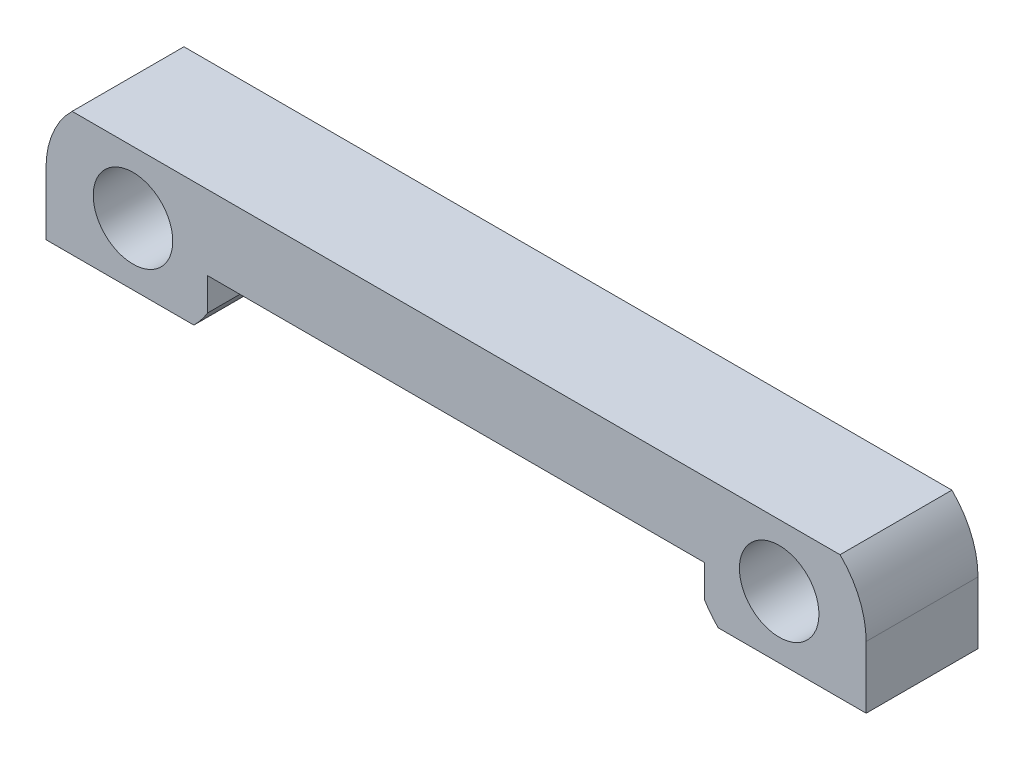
ISO-10303-21;
HEADER;
FILE_DESCRIPTION(('STEP AP214'),'2;1');
FILE_NAME('part.step','',(''),(''),'','','');
FILE_SCHEMA(('AUTOMOTIVE_DESIGN { 1 0 10303 214 1 1 1 1 }'));
ENDSEC;
DATA;
#1=APPLICATION_CONTEXT('core data for automotive mechanical design processes');
#2=APPLICATION_PROTOCOL_DEFINITION('international standard','automotive_design',2000,#1);
#3=PRODUCT_CONTEXT('',#1,'mechanical');
#4=PRODUCT('Part','Part','',(#3));
#5=PRODUCT_RELATED_PRODUCT_CATEGORY('part','',(#4));
#6=PRODUCT_DEFINITION_FORMATION('','',#4);
#7=PRODUCT_DEFINITION_CONTEXT('part definition',#1,'design');
#8=PRODUCT_DEFINITION('design','',#6,#7);
#9=PRODUCT_DEFINITION_SHAPE('','',#8);
#10=(LENGTH_UNIT() NAMED_UNIT(*) SI_UNIT(.MILLI.,.METRE.));
#11=(NAMED_UNIT(*) PLANE_ANGLE_UNIT() SI_UNIT($,.RADIAN.));
#12=(NAMED_UNIT(*) SI_UNIT($,.STERADIAN.) SOLID_ANGLE_UNIT());
#13=UNCERTAINTY_MEASURE_WITH_UNIT(LENGTH_MEASURE(1.E-05),#10,'distance_accuracy_value','');
#14=(GEOMETRIC_REPRESENTATION_CONTEXT(3) GLOBAL_UNCERTAINTY_ASSIGNED_CONTEXT((#13)) GLOBAL_UNIT_ASSIGNED_CONTEXT((#10,
#11,#12)) REPRESENTATION_CONTEXT('',''));
#15=CARTESIAN_POINT('',(0.,0.,0.));
#16=DIRECTION('',(0.,0.,1.));
#17=DIRECTION('',(1.,0.,0.));
#18=AXIS2_PLACEMENT_3D('',#15,#16,#17);
#19=CARTESIAN_POINT('',(-19.1549463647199,5.,-8.33849821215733));
#20=DIRECTION('',(1.,0.,0.));
#21=DIRECTION('',(0.,0.,-1.));
#22=AXIS2_PLACEMENT_3D('',#19,#20,#21);
#23=PLANE('',#22);
#24=DIRECTION('',(0.,0.,1.));
#25=VECTOR('',#24,1.);
#26=CARTESIAN_POINT('',(-19.1549463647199,2.5,-8.83849821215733));
#27=LINE('',#26,#25);
#28=CARTESIAN_POINT('',(-19.1549463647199,2.5,-8.33849821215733));
#29=VERTEX_POINT('',#28);
#30=CARTESIAN_POINT('',(-19.1549463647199,2.5,-3.83849821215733));
#31=VERTEX_POINT('',#30);
#32=EDGE_CURVE('E122',#29,#31,#27,.T.);
#33=ORIENTED_EDGE('',*,*,#32,.F.);
#34=DIRECTION('',(0.,-1.,0.));
#35=VECTOR('',#34,1.);
#36=CARTESIAN_POINT('',(-19.1549463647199,5.,-8.33849821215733));
#37=LINE('',#36,#35);
#38=CARTESIAN_POINT('',(-19.1549463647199,0.,-8.33849821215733));
#39=VERTEX_POINT('',#38);
#40=EDGE_CURVE('E177',#29,#39,#37,.T.);
#41=ORIENTED_EDGE('',*,*,#40,.T.);
#42=DIRECTION('',(0.,0.,1.));
#43=VECTOR('',#42,1.);
#44=CARTESIAN_POINT('',(-19.1549463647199,0.,-8.33849821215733));
#45=LINE('',#44,#43);
#46=CARTESIAN_POINT('',(-19.1549463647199,0.,-3.83849821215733));
#47=VERTEX_POINT('',#46);
#48=EDGE_CURVE('E144',#39,#47,#45,.T.);
#49=ORIENTED_EDGE('',*,*,#48,.T.);
#50=DIRECTION('',(0.,-1.,0.));
#51=VECTOR('',#50,1.);
#52=CARTESIAN_POINT('',(-19.1549463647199,5.,-3.83849821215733));
#53=LINE('',#52,#51);
#54=EDGE_CURVE('E135',#31,#47,#53,.T.);
#55=ORIENTED_EDGE('',*,*,#54,.F.);
#56=EDGE_LOOP('',(#33,#41,#49,#55));
#57=FACE_BOUND('',#56,.T.);
#58=ADVANCED_FACE('F35',(#57),#23,.F.);
#59=CARTESIAN_POINT('',(-19.1549463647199,5.,-3.83849821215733));
#60=DIRECTION('',(0.,0.,-1.));
#61=DIRECTION('',(-1.,0.,0.));
#62=AXIS2_PLACEMENT_3D('',#59,#60,#61);
#63=PLANE('',#62);
#64=CARTESIAN_POINT('',(-15.6549463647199,2.5,-3.83849821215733));
#65=DIRECTION('',(0.,0.,1.));
#66=DIRECTION('',(1.,0.,0.));
#67=AXIS2_PLACEMENT_3D('',#64,#65,#66);
#68=CIRCLE('',#67,1.6);
#69=CARTESIAN_POINT('',(-14.0549463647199,2.5,-3.83849821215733));
#70=VERTEX_POINT('',#69);
#71=EDGE_CURVE('E253',#70,#70,#68,.T.);
#72=ORIENTED_EDGE('',*,*,#71,.F.);
#73=EDGE_LOOP('',(#72));
#74=FACE_BOUND('',#73,.T.);
#75=CARTESIAN_POINT('',(10.3450536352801,2.5,-3.83849821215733));
#76=DIRECTION('',(0.,0.,1.));
#77=DIRECTION('',(1.,0.,0.));
#78=AXIS2_PLACEMENT_3D('',#75,#76,#77);
#79=CIRCLE('',#78,1.6);
#80=CARTESIAN_POINT('',(11.9450536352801,2.5,-3.83849821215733));
#81=VERTEX_POINT('',#80);
#82=EDGE_CURVE('E129',#81,#81,#79,.T.);
#83=ORIENTED_EDGE('',*,*,#82,.F.);
#84=EDGE_LOOP('',(#83));
#85=FACE_BOUND('',#84,.T.);
#86=CARTESIAN_POINT('',(-15.6549463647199,2.5,-3.83849821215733));
#87=DIRECTION('',(0.,0.,1.));
#88=DIRECTION('',(1.,0.,0.));
#89=AXIS2_PLACEMENT_3D('',#86,#87,#88);
#90=CIRCLE('',#89,3.5);
#91=CARTESIAN_POINT('',(-18.1044361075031,5.,-3.83849821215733));
#92=VERTEX_POINT('',#91);
#93=EDGE_CURVE('E59',#92,#31,#90,.T.);
#94=ORIENTED_EDGE('',*,*,#93,.T.);
#95=ORIENTED_EDGE('',*,*,#54,.T.);
#96=DIRECTION('',(1.,0.,0.));
#97=VECTOR('',#96,1.);
#98=CARTESIAN_POINT('',(-19.1549463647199,0.,-3.83849821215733));
#99=LINE('',#98,#97);
#100=CARTESIAN_POINT('',(-13.2054566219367,0.,-3.83849821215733));
#101=VERTEX_POINT('',#100);
#102=EDGE_CURVE('E180',#47,#101,#99,.T.);
#103=ORIENTED_EDGE('',*,*,#102,.T.);
#104=CARTESIAN_POINT('',(-15.6549463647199,2.5,-3.83849821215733));
#105=DIRECTION('',(0.,0.,1.));
#106=DIRECTION('',(1.,0.,0.));
#107=AXIS2_PLACEMENT_3D('',#104,#105,#106);
#108=CIRCLE('',#107,3.5);
#109=CARTESIAN_POINT('',(-12.6549463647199,0.697224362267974,-3.83849821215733));
#110=VERTEX_POINT('',#109);
#111=EDGE_CURVE('E214',#101,#110,#108,.T.);
#112=ORIENTED_EDGE('',*,*,#111,.T.);
#113=DIRECTION('',(0.,-1.,0.));
#114=VECTOR('',#113,1.);
#115=CARTESIAN_POINT('',(-12.6549463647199,0.,-3.83849821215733));
#116=LINE('',#115,#114);
#117=CARTESIAN_POINT('',(-12.6549463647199,2.,-3.83849821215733));
#118=VERTEX_POINT('',#117);
#119=EDGE_CURVE('E219',#118,#110,#116,.T.);
#120=ORIENTED_EDGE('',*,*,#119,.F.);
#121=DIRECTION('',(1.,0.,0.));
#122=VECTOR('',#121,1.);
#123=CARTESIAN_POINT('',(0.,2.,-3.83849821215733));
#124=LINE('',#123,#122);
#125=CARTESIAN_POINT('',(7.3450536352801,2.,-3.83849821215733));
#126=VERTEX_POINT('',#125);
#127=EDGE_CURVE('E216',#118,#126,#124,.T.);
#128=ORIENTED_EDGE('',*,*,#127,.T.);
#129=DIRECTION('',(0.,-1.,0.));
#130=VECTOR('',#129,1.);
#131=CARTESIAN_POINT('',(7.3450536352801,0.,-3.83849821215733));
#132=LINE('',#131,#130);
#133=CARTESIAN_POINT('',(7.3450536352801,0.697224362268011,-3.83849821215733));
#134=VERTEX_POINT('',#133);
#135=EDGE_CURVE('E213',#126,#134,#132,.T.);
#136=ORIENTED_EDGE('',*,*,#135,.T.);
#137=CARTESIAN_POINT('',(10.3450536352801,2.5,-3.83849821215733));
#138=DIRECTION('',(0.,0.,1.));
#139=DIRECTION('',(1.,0.,0.));
#140=AXIS2_PLACEMENT_3D('',#137,#138,#139);
#141=CIRCLE('',#140,3.5);
#142=CARTESIAN_POINT('',(7.89556389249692,0.,-3.83849821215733));
#143=VERTEX_POINT('',#142);
#144=EDGE_CURVE('E209',#134,#143,#141,.T.);
#145=ORIENTED_EDGE('',*,*,#144,.T.);
#146=CARTESIAN_POINT('',(13.8450536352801,0.,-3.83849821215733));
#147=VERTEX_POINT('',#146);
#148=EDGE_CURVE('E179',#143,#147,#99,.T.);
#149=ORIENTED_EDGE('',*,*,#148,.T.);
#150=DIRECTION('',(0.,-1.,0.));
#151=VECTOR('',#150,1.);
#152=CARTESIAN_POINT('',(13.8450536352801,5.,-3.83849821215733));
#153=LINE('',#152,#151);
#154=CARTESIAN_POINT('',(13.8450536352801,2.5,-3.83849821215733));
#155=VERTEX_POINT('',#154);
#156=EDGE_CURVE('E146',#155,#147,#153,.T.);
#157=ORIENTED_EDGE('',*,*,#156,.F.);
#158=CARTESIAN_POINT('',(10.3450536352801,2.5,-3.83849821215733));
#159=DIRECTION('',(0.,0.,1.));
#160=DIRECTION('',(1.,0.,0.));
#161=AXIS2_PLACEMENT_3D('',#158,#159,#160);
#162=CIRCLE('',#161,3.5);
#163=CARTESIAN_POINT('',(12.7945433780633,5.,-3.83849821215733));
#164=VERTEX_POINT('',#163);
#165=EDGE_CURVE('E260',#155,#164,#162,.T.);
#166=ORIENTED_EDGE('',*,*,#165,.T.);
#167=DIRECTION('',(1.,0.,0.));
#168=VECTOR('',#167,1.);
#169=CARTESIAN_POINT('',(-19.1549463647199,5.,-3.83849821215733));
#170=LINE('',#169,#168);
#171=EDGE_CURVE('E139',#92,#164,#170,.T.);
#172=ORIENTED_EDGE('',*,*,#171,.F.);
#173=EDGE_LOOP('',(#94,#95,#103,#112,#120,#128,#136,#145,#149,#157,#166,#172));
#174=FACE_BOUND('',#173,.T.);
#175=ADVANCED_FACE('F133',(#74,#85,#174),#63,.F.);
#176=CARTESIAN_POINT('',(-19.1549463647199,5.,-8.33849821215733));
#177=DIRECTION('',(0.,0.,1.));
#178=DIRECTION('',(1.,0.,0.));
#179=AXIS2_PLACEMENT_3D('',#176,#177,#178);
#180=PLANE('',#179);
#181=CARTESIAN_POINT('',(-15.6549463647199,2.5,-8.33849821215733));
#182=DIRECTION('',(0.,0.,1.));
#183=DIRECTION('',(1.,0.,0.));
#184=AXIS2_PLACEMENT_3D('',#181,#182,#183);
#185=CIRCLE('',#184,1.6);
#186=CARTESIAN_POINT('',(-14.0549463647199,2.5,-8.33849821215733));
#187=VERTEX_POINT('',#186);
#188=EDGE_CURVE('E38',#187,#187,#185,.T.);
#189=ORIENTED_EDGE('',*,*,#188,.T.);
#190=EDGE_LOOP('',(#189));
#191=FACE_BOUND('',#190,.T.);
#192=CARTESIAN_POINT('',(10.3450536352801,2.5,-8.33849821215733));
#193=DIRECTION('',(0.,0.,1.));
#194=DIRECTION('',(1.,0.,0.));
#195=AXIS2_PLACEMENT_3D('',#192,#193,#194);
#196=CIRCLE('',#195,1.6);
#197=CARTESIAN_POINT('',(11.9450536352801,2.5,-8.33849821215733));
#198=VERTEX_POINT('',#197);
#199=EDGE_CURVE('E162',#198,#198,#196,.T.);
#200=ORIENTED_EDGE('',*,*,#199,.T.);
#201=EDGE_LOOP('',(#200));
#202=FACE_BOUND('',#201,.T.);
#203=CARTESIAN_POINT('',(-15.6549463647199,2.5,-8.33849821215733));
#204=DIRECTION('',(0.,0.,1.));
#205=DIRECTION('',(1.,0.,0.));
#206=AXIS2_PLACEMENT_3D('',#203,#204,#205);
#207=CIRCLE('',#206,3.5);
#208=CARTESIAN_POINT('',(-18.1044361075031,5.,-8.33849821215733));
#209=VERTEX_POINT('',#208);
#210=EDGE_CURVE('E125',#209,#29,#207,.T.);
#211=ORIENTED_EDGE('',*,*,#210,.F.);
#212=DIRECTION('',(-1.,0.,0.));
#213=VECTOR('',#212,1.);
#214=CARTESIAN_POINT('',(-19.1549463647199,5.,-8.33849821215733));
#215=LINE('',#214,#213);
#216=CARTESIAN_POINT('',(12.7945433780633,5.,-8.33849821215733));
#217=VERTEX_POINT('',#216);
#218=EDGE_CURVE('E173',#217,#209,#215,.T.);
#219=ORIENTED_EDGE('',*,*,#218,.F.);
#220=CARTESIAN_POINT('',(10.3450536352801,2.5,-8.33849821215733));
#221=DIRECTION('',(0.,0.,1.));
#222=DIRECTION('',(1.,0.,0.));
#223=AXIS2_PLACEMENT_3D('',#220,#221,#222);
#224=CIRCLE('',#223,3.5);
#225=CARTESIAN_POINT('',(13.8450536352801,2.5,-8.33849821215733));
#226=VERTEX_POINT('',#225);
#227=EDGE_CURVE('E51',#226,#217,#224,.T.);
#228=ORIENTED_EDGE('',*,*,#227,.F.);
#229=DIRECTION('',(0.,-1.,0.));
#230=VECTOR('',#229,1.);
#231=CARTESIAN_POINT('',(13.8450536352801,5.,-8.33849821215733));
#232=LINE('',#231,#230);
#233=CARTESIAN_POINT('',(13.8450536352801,0.,-8.33849821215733));
#234=VERTEX_POINT('',#233);
#235=EDGE_CURVE('E150',#226,#234,#232,.T.);
#236=ORIENTED_EDGE('',*,*,#235,.T.);
#237=DIRECTION('',(-1.,0.,0.));
#238=VECTOR('',#237,1.);
#239=CARTESIAN_POINT('',(-19.1549463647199,0.,-8.33849821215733));
#240=LINE('',#239,#238);
#241=CARTESIAN_POINT('',(7.89556389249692,0.,-8.33849821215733));
#242=VERTEX_POINT('',#241);
#243=EDGE_CURVE('E174',#234,#242,#240,.T.);
#244=ORIENTED_EDGE('',*,*,#243,.T.);
#245=CARTESIAN_POINT('',(10.3450536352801,2.5,-8.33849821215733));
#246=DIRECTION('',(0.,0.,1.));
#247=DIRECTION('',(1.,0.,0.));
#248=AXIS2_PLACEMENT_3D('',#245,#246,#247);
#249=CIRCLE('',#248,3.5);
#250=CARTESIAN_POINT('',(7.3450536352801,0.697224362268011,-8.33849821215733));
#251=VERTEX_POINT('',#250);
#252=EDGE_CURVE('E168',#251,#242,#249,.T.);
#253=ORIENTED_EDGE('',*,*,#252,.F.);
#254=DIRECTION('',(0.,-1.,0.));
#255=VECTOR('',#254,1.);
#256=CARTESIAN_POINT('',(7.3450536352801,5.,-8.33849821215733));
#257=LINE('',#256,#255);
#258=CARTESIAN_POINT('',(7.3450536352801,2.,-8.33849821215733));
#259=VERTEX_POINT('',#258);
#260=EDGE_CURVE('E11',#259,#251,#257,.T.);
#261=ORIENTED_EDGE('',*,*,#260,.F.);
#262=DIRECTION('',(1.,0.,0.));
#263=VECTOR('',#262,1.);
#264=CARTESIAN_POINT('',(-19.1549463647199,2.,-8.33849821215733));
#265=LINE('',#264,#263);
#266=CARTESIAN_POINT('',(-12.6549463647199,2.,-8.33849821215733));
#267=VERTEX_POINT('',#266);
#268=EDGE_CURVE('E43',#267,#259,#265,.T.);
#269=ORIENTED_EDGE('',*,*,#268,.F.);
#270=DIRECTION('',(0.,-1.,0.));
#271=VECTOR('',#270,1.);
#272=CARTESIAN_POINT('',(-12.6549463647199,5.,-8.33849821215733));
#273=LINE('',#272,#271);
#274=CARTESIAN_POINT('',(-12.6549463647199,0.697224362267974,-8.33849821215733));
#275=VERTEX_POINT('',#274);
#276=EDGE_CURVE('E159',#267,#275,#273,.T.);
#277=ORIENTED_EDGE('',*,*,#276,.T.);
#278=CARTESIAN_POINT('',(-15.6549463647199,2.5,-8.33849821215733));
#279=DIRECTION('',(0.,0.,1.));
#280=DIRECTION('',(1.,0.,0.));
#281=AXIS2_PLACEMENT_3D('',#278,#279,#280);
#282=CIRCLE('',#281,3.5);
#283=CARTESIAN_POINT('',(-13.2054566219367,0.,-8.33849821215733));
#284=VERTEX_POINT('',#283);
#285=EDGE_CURVE('E227',#284,#275,#282,.T.);
#286=ORIENTED_EDGE('',*,*,#285,.F.);
#287=EDGE_CURVE('E185',#284,#39,#240,.T.);
#288=ORIENTED_EDGE('',*,*,#287,.T.);
#289=ORIENTED_EDGE('',*,*,#40,.F.);
#290=EDGE_LOOP('',(#211,#219,#228,#236,#244,#253,#261,#269,#277,#286,#288,#289));
#291=FACE_BOUND('',#290,.T.);
#292=ADVANCED_FACE('F190',(#191,#202,#291),#180,.F.);
#293=CARTESIAN_POINT('',(0.,5.,0.));
#294=DIRECTION('',(0.,1.,0.));
#295=DIRECTION('',(0.,0.,1.));
#296=AXIS2_PLACEMENT_3D('',#293,#294,#295);
#297=PLANE('',#296);
#298=ORIENTED_EDGE('',*,*,#218,.T.);
#299=DIRECTION('',(0.,0.,1.));
#300=VECTOR('',#299,1.);
#301=CARTESIAN_POINT('',(-18.1044361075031,5.,-8.83849821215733));
#302=LINE('',#301,#300);
#303=EDGE_CURVE('E157',#209,#92,#302,.T.);
#304=ORIENTED_EDGE('',*,*,#303,.T.);
#305=ORIENTED_EDGE('',*,*,#171,.T.);
#306=DIRECTION('',(0.,0.,1.));
#307=VECTOR('',#306,1.);
#308=CARTESIAN_POINT('',(12.7945433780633,5.,-8.83849821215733));
#309=LINE('',#308,#307);
#310=EDGE_CURVE('E155',#164,#217,#309,.F.);
#311=ORIENTED_EDGE('',*,*,#310,.T.);
#312=EDGE_LOOP('',(#298,#304,#305,#311));
#313=FACE_BOUND('',#312,.T.);
#314=ADVANCED_FACE('F262',(#313),#297,.T.);
#315=CARTESIAN_POINT('',(0.,0.,0.));
#316=DIRECTION('',(0.,1.,0.));
#317=DIRECTION('',(0.,0.,1.));
#318=AXIS2_PLACEMENT_3D('',#315,#316,#317);
#319=PLANE('',#318);
#320=DIRECTION('',(0.,0.,1.));
#321=VECTOR('',#320,1.);
#322=CARTESIAN_POINT('',(7.89556389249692,0.,-8.83849821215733));
#323=LINE('',#322,#321);
#324=EDGE_CURVE('E148',#242,#143,#323,.T.);
#325=ORIENTED_EDGE('',*,*,#324,.F.);
#326=ORIENTED_EDGE('',*,*,#243,.F.);
#327=DIRECTION('',(0.,0.,-1.));
#328=VECTOR('',#327,1.);
#329=CARTESIAN_POINT('',(13.8450536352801,0.,-8.33849821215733));
#330=LINE('',#329,#328);
#331=EDGE_CURVE('E182',#147,#234,#330,.T.);
#332=ORIENTED_EDGE('',*,*,#331,.F.);
#333=ORIENTED_EDGE('',*,*,#148,.F.);
#334=EDGE_LOOP('',(#325,#326,#332,#333));
#335=FACE_BOUND('',#334,.T.);
#336=ADVANCED_FACE('F203',(#335),#319,.F.);
#337=DIRECTION('',(0.,0.,1.));
#338=VECTOR('',#337,1.);
#339=CARTESIAN_POINT('',(-13.2054566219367,0.,-8.83849821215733));
#340=LINE('',#339,#338);
#341=EDGE_CURVE('E145',#101,#284,#340,.F.);
#342=ORIENTED_EDGE('',*,*,#341,.F.);
#343=ORIENTED_EDGE('',*,*,#102,.F.);
#344=ORIENTED_EDGE('',*,*,#48,.F.);
#345=ORIENTED_EDGE('',*,*,#287,.F.);
#346=EDGE_LOOP('',(#342,#343,#344,#345));
#347=FACE_BOUND('',#346,.T.);
#348=ADVANCED_FACE('F264',(#347),#319,.F.);
#349=CARTESIAN_POINT('',(13.8450536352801,5.,-8.33849821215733));
#350=DIRECTION('',(-1.,0.,0.));
#351=DIRECTION('',(0.,0.,1.));
#352=AXIS2_PLACEMENT_3D('',#349,#350,#351);
#353=PLANE('',#352);
#354=ORIENTED_EDGE('',*,*,#235,.F.);
#355=DIRECTION('',(0.,0.,1.));
#356=VECTOR('',#355,1.);
#357=CARTESIAN_POINT('',(13.8450536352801,2.5,-8.83849821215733));
#358=LINE('',#357,#356);
#359=EDGE_CURVE('E140',#226,#155,#358,.T.);
#360=ORIENTED_EDGE('',*,*,#359,.T.);
#361=ORIENTED_EDGE('',*,*,#156,.T.);
#362=ORIENTED_EDGE('',*,*,#331,.T.);
#363=EDGE_LOOP('',(#354,#360,#361,#362));
#364=FACE_BOUND('',#363,.T.);
#365=ADVANCED_FACE('F197',(#364),#353,.F.);
#366=CARTESIAN_POINT('',(-12.6549463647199,0.,-8.83849821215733));
#367=DIRECTION('',(-1.,0.,0.));
#368=DIRECTION('',(0.,0.,1.));
#369=AXIS2_PLACEMENT_3D('',#366,#367,#368);
#370=PLANE('',#369);
#371=DIRECTION('',(0.,0.,1.));
#372=VECTOR('',#371,1.);
#373=CARTESIAN_POINT('',(-12.6549463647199,2.,-8.83849821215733));
#374=LINE('',#373,#372);
#375=EDGE_CURVE('E225',#267,#118,#374,.T.);
#376=ORIENTED_EDGE('',*,*,#375,.T.);
#377=ORIENTED_EDGE('',*,*,#119,.T.);
#378=DIRECTION('',(0.,0.,1.));
#379=VECTOR('',#378,1.);
#380=CARTESIAN_POINT('',(-12.6549463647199,0.697224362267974,-8.83849821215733));
#381=LINE('',#380,#379);
#382=EDGE_CURVE('E224',#275,#110,#381,.T.);
#383=ORIENTED_EDGE('',*,*,#382,.F.);
#384=ORIENTED_EDGE('',*,*,#276,.F.);
#385=EDGE_LOOP('',(#376,#377,#383,#384));
#386=FACE_BOUND('',#385,.T.);
#387=ADVANCED_FACE('F242',(#386),#370,.F.);
#388=CARTESIAN_POINT('',(0.,2.,-8.83849821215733));
#389=DIRECTION('',(0.,-1.,0.));
#390=DIRECTION('',(0.,0.,-1.));
#391=AXIS2_PLACEMENT_3D('',#388,#389,#390);
#392=PLANE('',#391);
#393=ORIENTED_EDGE('',*,*,#268,.T.);
#394=DIRECTION('',(0.,0.,1.));
#395=VECTOR('',#394,1.);
#396=CARTESIAN_POINT('',(7.3450536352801,2.,-8.83849821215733));
#397=LINE('',#396,#395);
#398=EDGE_CURVE('E228',#259,#126,#397,.T.);
#399=ORIENTED_EDGE('',*,*,#398,.T.);
#400=ORIENTED_EDGE('',*,*,#127,.F.);
#401=ORIENTED_EDGE('',*,*,#375,.F.);
#402=EDGE_LOOP('',(#393,#399,#400,#401));
#403=FACE_BOUND('',#402,.T.);
#404=ADVANCED_FACE('F249',(#403),#392,.T.);
#405=CARTESIAN_POINT('',(7.3450536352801,0.,-8.83849821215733));
#406=DIRECTION('',(-1.,0.,0.));
#407=DIRECTION('',(0.,-1.,0.));
#408=AXIS2_PLACEMENT_3D('',#405,#406,#407);
#409=PLANE('',#408);
#410=ORIENTED_EDGE('',*,*,#260,.T.);
#411=DIRECTION('',(0.,0.,1.));
#412=VECTOR('',#411,1.);
#413=CARTESIAN_POINT('',(7.3450536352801,0.697224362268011,-8.83849821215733));
#414=LINE('',#413,#412);
#415=EDGE_CURVE('E230',#251,#134,#414,.T.);
#416=ORIENTED_EDGE('',*,*,#415,.T.);
#417=ORIENTED_EDGE('',*,*,#135,.F.);
#418=ORIENTED_EDGE('',*,*,#398,.F.);
#419=EDGE_LOOP('',(#410,#416,#417,#418));
#420=FACE_BOUND('',#419,.T.);
#421=ADVANCED_FACE('F252',(#420),#409,.T.);
#422=CARTESIAN_POINT('',(10.3450536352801,2.5,-8.83849821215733));
#423=DIRECTION('',(0.,0.,1.));
#424=DIRECTION('',(1.,0.,0.));
#425=AXIS2_PLACEMENT_3D('',#422,#423,#424);
#426=CYLINDRICAL_SURFACE('',#425,3.5);
#427=ORIENTED_EDGE('',*,*,#252,.T.);
#428=ORIENTED_EDGE('',*,*,#324,.T.);
#429=ORIENTED_EDGE('',*,*,#144,.F.);
#430=ORIENTED_EDGE('',*,*,#415,.F.);
#431=EDGE_LOOP('',(#427,#428,#429,#430));
#432=FACE_BOUND('',#431,.T.);
#433=ADVANCED_FACE('F207',(#432),#426,.T.);
#434=CARTESIAN_POINT('',(-15.6549463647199,2.5,-8.83849821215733));
#435=DIRECTION('',(0.,0.,1.));
#436=DIRECTION('',(1.,0.,0.));
#437=AXIS2_PLACEMENT_3D('',#434,#435,#436);
#438=CYLINDRICAL_SURFACE('',#437,3.5);
#439=ORIENTED_EDGE('',*,*,#285,.T.);
#440=ORIENTED_EDGE('',*,*,#382,.T.);
#441=ORIENTED_EDGE('',*,*,#111,.F.);
#442=ORIENTED_EDGE('',*,*,#341,.T.);
#443=EDGE_LOOP('',(#439,#440,#441,#442));
#444=FACE_BOUND('',#443,.T.);
#445=ADVANCED_FACE('F236',(#444),#438,.T.);
#446=CARTESIAN_POINT('',(10.3450536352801,2.5,-8.83849821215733));
#447=DIRECTION('',(0.,0.,1.));
#448=DIRECTION('',(1.,0.,0.));
#449=AXIS2_PLACEMENT_3D('',#446,#447,#448);
#450=CYLINDRICAL_SURFACE('',#449,3.5);
#451=ORIENTED_EDGE('',*,*,#227,.T.);
#452=ORIENTED_EDGE('',*,*,#310,.F.);
#453=ORIENTED_EDGE('',*,*,#165,.F.);
#454=ORIENTED_EDGE('',*,*,#359,.F.);
#455=EDGE_LOOP('',(#451,#452,#453,#454));
#456=FACE_BOUND('',#455,.T.);
#457=ADVANCED_FACE('F298',(#456),#450,.T.);
#458=CARTESIAN_POINT('',(-15.6549463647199,2.5,-8.83849821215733));
#459=DIRECTION('',(0.,0.,1.));
#460=DIRECTION('',(1.,0.,0.));
#461=AXIS2_PLACEMENT_3D('',#458,#459,#460);
#462=CYLINDRICAL_SURFACE('',#461,3.5);
#463=ORIENTED_EDGE('',*,*,#210,.T.);
#464=ORIENTED_EDGE('',*,*,#32,.T.);
#465=ORIENTED_EDGE('',*,*,#93,.F.);
#466=ORIENTED_EDGE('',*,*,#303,.F.);
#467=EDGE_LOOP('',(#463,#464,#465,#466));
#468=FACE_BOUND('',#467,.T.);
#469=ADVANCED_FACE('F123',(#468),#462,.T.);
#470=CARTESIAN_POINT('',(10.3450536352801,2.5,-8.83849821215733));
#471=DIRECTION('',(0.,0.,1.));
#472=DIRECTION('',(1.,0.,0.));
#473=AXIS2_PLACEMENT_3D('',#470,#471,#472);
#474=CYLINDRICAL_SURFACE('',#473,1.6);
#475=ORIENTED_EDGE('',*,*,#82,.T.);
#476=EDGE_LOOP('',(#475));
#477=FACE_BOUND('',#476,.T.);
#478=ORIENTED_EDGE('',*,*,#199,.F.);
#479=EDGE_LOOP('',(#478));
#480=FACE_BOUND('',#479,.T.);
#481=ADVANCED_FACE('F287',(#477,#480),#474,.F.);
#482=CARTESIAN_POINT('',(-15.6549463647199,2.5,-8.83849821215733));
#483=DIRECTION('',(0.,0.,1.));
#484=DIRECTION('',(1.,0.,0.));
#485=AXIS2_PLACEMENT_3D('',#482,#483,#484);
#486=CYLINDRICAL_SURFACE('',#485,1.6);
#487=ORIENTED_EDGE('',*,*,#71,.T.);
#488=EDGE_LOOP('',(#487));
#489=FACE_BOUND('',#488,.T.);
#490=ORIENTED_EDGE('',*,*,#188,.F.);
#491=EDGE_LOOP('',(#490));
#492=FACE_BOUND('',#491,.T.);
#493=ADVANCED_FACE('F290',(#489,#492),#486,.F.);
#494=CLOSED_SHELL('',(#58,#175,#292,#314,#336,#348,#365,#387,#404,#421,#433,#445,#457,#469,#481,#493));
#495=MANIFOLD_SOLID_BREP('B2',#494);
#496=ADVANCED_BREP_SHAPE_REPRESENTATION('',(#18,#495),#14);
#497=SHAPE_DEFINITION_REPRESENTATION(#9,#496);
ENDSEC;
END-ISO-10303-21;
